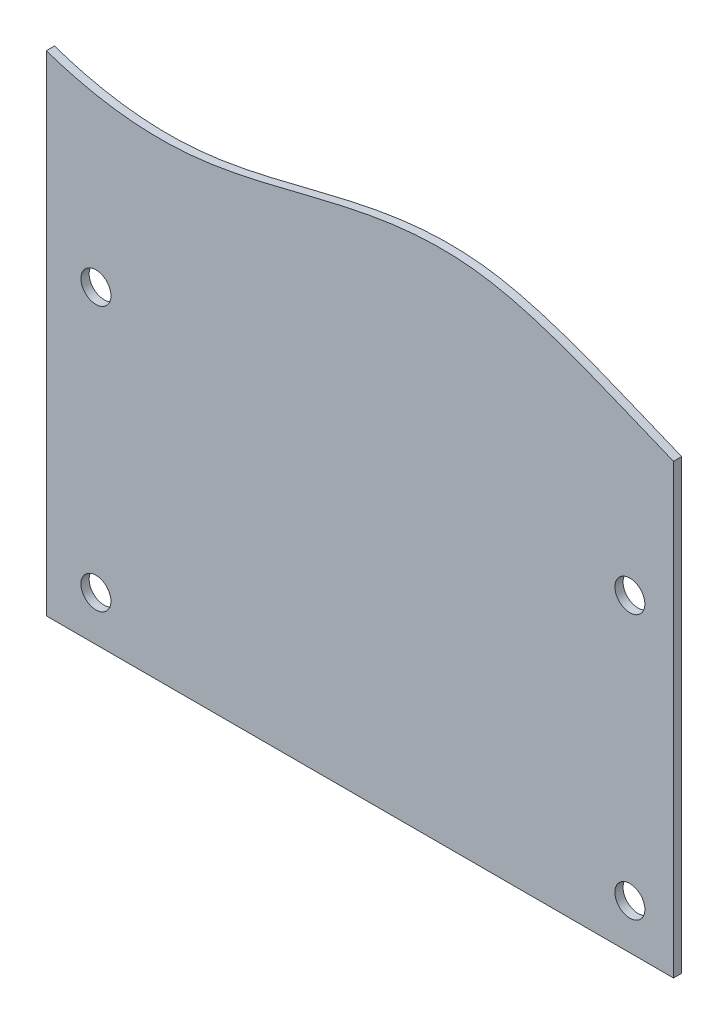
from build123d import *

# Parameters (mm, degrees)
ESQUISSE1_W             = 230
ESQUISSE1_H             = 320
EXTRUSION1_DEPTH        = 3
ESQUISSE2_R             = 5.5
ENL_V_MAT_EXTRU_1_DEPTH = 395.092628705
ENL_V_MAT_EXTRU_2_DEPTH = 10


with BuildPart() as part:
    # Esquisse1 → Extrusion1 (new body)
    with BuildSketch(Plane.XY):
        with Locations((-115, 160)):
            Rectangle(ESQUISSE1_W, ESQUISSE1_H)
    extrude(amount=EXTRUSION1_DEPTH)

    # Esquisse2 → Enl_v. mat.-Extru.1 (cut, through all)
    with BuildSketch(Plane.XY.offset(3)):
        with Locations((-16, 16.5)):
            Circle(ESQUISSE2_R)
        with Locations((-16, 113.5)):
            Circle(ESQUISSE2_R)
        with Locations((-211.8, 113.5)):
            Circle(ESQUISSE2_R)
        with Locations((-211.8, 16.5)):
            Circle(ESQUISSE2_R)
    extrude(amount=-ENL_V_MAT_EXTRU_1_DEPTH, mode=Mode.SUBTRACT)

    # Esquisse3 → Enl_v. mat.-Extru.2 (cut)
    with BuildSketch(Plane(origin=(0, 0, 0), x_dir=(-1, 0, 0), z_dir=(0, 0, -1))):
        with BuildLine():
            add(Edge.make_bspline(
                [(-48.98725876, 156.702267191), (-24.015224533, 144.78644037), (69.626602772, 213.580453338), (158.379706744, 167.448502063), (243.23372687, 176.535771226), (333.391318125, 241.115847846), (215.593643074, 361.970685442), (102.268187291, 312.435660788), (-2.040765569, 347.651654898), (-71.018533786, 286.923763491), (-79.791981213, 171.40125946), (-48.98725876, 156.702267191)],
                knots=[0, 0, 0, 0, 0.13266904, 0.25035523, 0.308940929, 0.414317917, 0.513574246, 0.715334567, 0.785901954, 0.836343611, 1, 1, 1, 1], degree=3))
        make_face()
    extrude(amount=-ENL_V_MAT_EXTRU_2_DEPTH, mode=Mode.SUBTRACT)


solid = part.part
